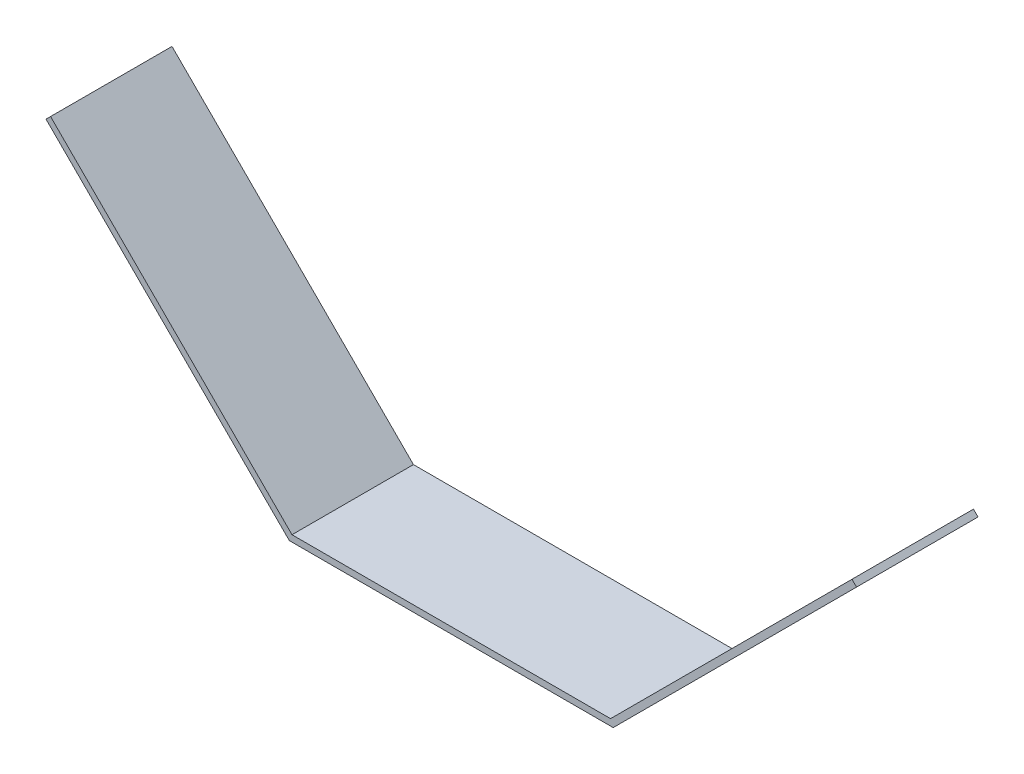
ISO-10303-21;
HEADER;
FILE_DESCRIPTION(('STEP AP214'),'2;1');
FILE_NAME('part.step','',(''),(''),'','','');
FILE_SCHEMA(('AUTOMOTIVE_DESIGN { 1 0 10303 214 1 1 1 1 }'));
ENDSEC;
DATA;
#1=APPLICATION_CONTEXT('core data for automotive mechanical design processes');
#2=APPLICATION_PROTOCOL_DEFINITION('international standard','automotive_design',2000,#1);
#3=PRODUCT_CONTEXT('',#1,'mechanical');
#4=PRODUCT('Part','Part','',(#3));
#5=PRODUCT_RELATED_PRODUCT_CATEGORY('part','',(#4));
#6=PRODUCT_DEFINITION_FORMATION('','',#4);
#7=PRODUCT_DEFINITION_CONTEXT('part definition',#1,'design');
#8=PRODUCT_DEFINITION('design','',#6,#7);
#9=PRODUCT_DEFINITION_SHAPE('','',#8);
#10=(LENGTH_UNIT() NAMED_UNIT(*) SI_UNIT(.MILLI.,.METRE.));
#11=(NAMED_UNIT(*) PLANE_ANGLE_UNIT() SI_UNIT($,.RADIAN.));
#12=(NAMED_UNIT(*) SI_UNIT($,.STERADIAN.) SOLID_ANGLE_UNIT());
#13=UNCERTAINTY_MEASURE_WITH_UNIT(LENGTH_MEASURE(1.E-05),#10,'distance_accuracy_value','');
#14=(GEOMETRIC_REPRESENTATION_CONTEXT(3) GLOBAL_UNCERTAINTY_ASSIGNED_CONTEXT((#13)) GLOBAL_UNIT_ASSIGNED_CONTEXT((#10,
#11,#12)) REPRESENTATION_CONTEXT('',''));
#15=CARTESIAN_POINT('',(0.,0.,0.));
#16=DIRECTION('',(0.,0.,1.));
#17=DIRECTION('',(1.,0.,0.));
#18=AXIS2_PLACEMENT_3D('',#15,#16,#17);
#19=CARTESIAN_POINT('',(80.,0.,60.));
#20=DIRECTION('',(-0.707106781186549,0.707106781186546,0.));
#21=DIRECTION('',(-0.707106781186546,-0.707106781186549,0.));
#22=AXIS2_PLACEMENT_3D('',#19,#20,#21);
#23=PLANE('',#22);
#24=DIRECTION('',(0.707106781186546,0.707106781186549,0.));
#25=VECTOR('',#24,1.);
#26=CARTESIAN_POINT('',(80.,0.,0.));
#27=LINE('',#26,#25);
#28=CARTESIAN_POINT('',(80.,0.,0.));
#29=VERTEX_POINT('',#28);
#30=CARTESIAN_POINT('',(200.208152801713,120.208152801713,0.));
#31=VERTEX_POINT('',#30);
#32=EDGE_CURVE('E140',#29,#31,#27,.T.);
#33=ORIENTED_EDGE('',*,*,#32,.T.);
#34=DIRECTION('',(0.,0.,-1.));
#35=VECTOR('',#34,1.);
#36=CARTESIAN_POINT('',(200.208152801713,120.208152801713,60.));
#37=LINE('',#36,#35);
#38=CARTESIAN_POINT('',(200.208152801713,120.208152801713,60.));
#39=VERTEX_POINT('',#38);
#40=EDGE_CURVE('E11',#39,#31,#37,.T.);
#41=ORIENTED_EDGE('',*,*,#40,.F.);
#42=DIRECTION('',(0.707106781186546,0.707106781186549,0.));
#43=VECTOR('',#42,1.);
#44=CARTESIAN_POINT('',(80.,0.,60.));
#45=LINE('',#44,#43);
#46=CARTESIAN_POINT('',(80.,0.,60.));
#47=VERTEX_POINT('',#46);
#48=EDGE_CURVE('E162',#47,#39,#45,.T.);
#49=ORIENTED_EDGE('',*,*,#48,.F.);
#50=DIRECTION('',(0.,0.,-1.));
#51=VECTOR('',#50,1.);
#52=CARTESIAN_POINT('',(80.,0.,60.));
#53=LINE('',#52,#51);
#54=EDGE_CURVE('E136',#47,#29,#53,.T.);
#55=ORIENTED_EDGE('',*,*,#54,.T.);
#56=EDGE_LOOP('',(#33,#41,#49,#55));
#57=FACE_BOUND('',#56,.T.);
#58=ADVANCED_FACE('F39',(#57),#23,.F.);
#59=CARTESIAN_POINT('',(200.208152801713,120.208152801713,60.));
#60=DIRECTION('',(-0.707106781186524,-0.707106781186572,0.));
#61=DIRECTION('',(0.707106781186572,-0.707106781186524,0.));
#62=AXIS2_PLACEMENT_3D('',#59,#60,#61);
#63=PLANE('',#62);
#64=DIRECTION('',(-0.707106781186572,0.707106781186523,0.));
#65=VECTOR('',#64,1.);
#66=CARTESIAN_POINT('',(200.208152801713,120.208152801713,0.));
#67=LINE('',#66,#65);
#68=CARTESIAN_POINT('',(197.963088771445,122.453216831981,0.));
#69=VERTEX_POINT('',#68);
#70=EDGE_CURVE('E144',#31,#69,#67,.T.);
#71=ORIENTED_EDGE('',*,*,#70,.T.);
#72=DIRECTION('',(0.,0.,-1.));
#73=VECTOR('',#72,1.);
#74=CARTESIAN_POINT('',(197.963088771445,122.453216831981,60.));
#75=LINE('',#74,#73);
#76=CARTESIAN_POINT('',(197.963088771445,122.453216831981,60.));
#77=VERTEX_POINT('',#76);
#78=EDGE_CURVE('E48',#77,#69,#75,.T.);
#79=ORIENTED_EDGE('',*,*,#78,.F.);
#80=DIRECTION('',(-0.707106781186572,0.707106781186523,0.));
#81=VECTOR('',#80,1.);
#82=CARTESIAN_POINT('',(200.208152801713,120.208152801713,60.));
#83=LINE('',#82,#81);
#84=EDGE_CURVE('E99',#39,#77,#83,.T.);
#85=ORIENTED_EDGE('',*,*,#84,.F.);
#86=ORIENTED_EDGE('',*,*,#40,.T.);
#87=EDGE_LOOP('',(#71,#79,#85,#86));
#88=FACE_BOUND('',#87,.T.);
#89=ADVANCED_FACE('F208',(#88),#63,.F.);
#90=CARTESIAN_POINT('',(197.963088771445,122.453216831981,60.));
#91=DIRECTION('',(0.707106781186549,-0.707106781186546,0.));
#92=DIRECTION('',(0.707106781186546,0.707106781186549,0.));
#93=AXIS2_PLACEMENT_3D('',#90,#91,#92);
#94=PLANE('',#93);
#95=DIRECTION('',(-0.707106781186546,-0.707106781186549,0.));
#96=VECTOR('',#95,1.);
#97=CARTESIAN_POINT('',(197.963088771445,122.453216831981,0.));
#98=LINE('',#97,#96);
#99=CARTESIAN_POINT('',(78.6848719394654,3.17499999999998,0.));
#100=VERTEX_POINT('',#99);
#101=EDGE_CURVE('E147',#69,#100,#98,.T.);
#102=ORIENTED_EDGE('',*,*,#101,.T.);
#103=DIRECTION('',(0.,0.,-1.));
#104=VECTOR('',#103,1.);
#105=CARTESIAN_POINT('',(78.6848719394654,3.17499999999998,60.));
#106=LINE('',#105,#104);
#107=CARTESIAN_POINT('',(78.6848719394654,3.17499999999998,60.));
#108=VERTEX_POINT('',#107);
#109=EDGE_CURVE('E173',#108,#100,#106,.T.);
#110=ORIENTED_EDGE('',*,*,#109,.F.);
#111=DIRECTION('',(-0.707106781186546,-0.707106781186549,0.));
#112=VECTOR('',#111,1.);
#113=CARTESIAN_POINT('',(197.963088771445,122.453216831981,60.));
#114=LINE('',#113,#112);
#115=EDGE_CURVE('E183',#77,#108,#114,.T.);
#116=ORIENTED_EDGE('',*,*,#115,.F.);
#117=ORIENTED_EDGE('',*,*,#78,.T.);
#118=EDGE_LOOP('',(#102,#110,#116,#117));
#119=FACE_BOUND('',#118,.T.);
#120=ADVANCED_FACE('F181',(#119),#94,.F.);
#121=CARTESIAN_POINT('',(78.6848719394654,3.17499999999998,60.));
#122=DIRECTION('',(0.,-1.,0.));
#123=DIRECTION('',(0.,0.,-1.));
#124=AXIS2_PLACEMENT_3D('',#121,#122,#123);
#125=PLANE('',#124);
#126=DIRECTION('',(-1.,0.,0.));
#127=VECTOR('',#126,1.);
#128=CARTESIAN_POINT('',(78.6848719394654,3.17499999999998,0.));
#129=LINE('',#128,#127);
#130=CARTESIAN_POINT('',(-78.6848719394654,3.17499999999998,0.));
#131=VERTEX_POINT('',#130);
#132=EDGE_CURVE('E150',#100,#131,#129,.T.);
#133=ORIENTED_EDGE('',*,*,#132,.T.);
#134=DIRECTION('',(0.,0.,-1.));
#135=VECTOR('',#134,1.);
#136=CARTESIAN_POINT('',(-78.6848719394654,3.17499999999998,60.));
#137=LINE('',#136,#135);
#138=CARTESIAN_POINT('',(-78.6848719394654,3.17499999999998,60.));
#139=VERTEX_POINT('',#138);
#140=EDGE_CURVE('E169',#139,#131,#137,.T.);
#141=ORIENTED_EDGE('',*,*,#140,.F.);
#142=DIRECTION('',(-1.,0.,0.));
#143=VECTOR('',#142,1.);
#144=CARTESIAN_POINT('',(78.6848719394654,3.17499999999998,60.));
#145=LINE('',#144,#143);
#146=EDGE_CURVE('E196',#108,#139,#145,.T.);
#147=ORIENTED_EDGE('',*,*,#146,.F.);
#148=ORIENTED_EDGE('',*,*,#109,.T.);
#149=EDGE_LOOP('',(#133,#141,#147,#148));
#150=FACE_BOUND('',#149,.T.);
#151=ADVANCED_FACE('F191',(#150),#125,.F.);
#152=CARTESIAN_POINT('',(-197.963088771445,122.453216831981,60.));
#153=DIRECTION('',(-0.707106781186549,-0.707106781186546,0.));
#154=DIRECTION('',(0.707106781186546,-0.707106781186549,0.));
#155=AXIS2_PLACEMENT_3D('',#152,#153,#154);
#156=PLANE('',#155);
#157=DIRECTION('',(-0.707106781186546,0.707106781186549,0.));
#158=VECTOR('',#157,1.);
#159=CARTESIAN_POINT('',(-197.963088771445,122.453216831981,0.));
#160=LINE('',#159,#158);
#161=CARTESIAN_POINT('',(-197.963088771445,122.453216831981,0.));
#162=VERTEX_POINT('',#161);
#163=EDGE_CURVE('E153',#131,#162,#160,.T.);
#164=ORIENTED_EDGE('',*,*,#163,.T.);
#165=DIRECTION('',(0.,0.,-1.));
#166=VECTOR('',#165,1.);
#167=CARTESIAN_POINT('',(-197.963088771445,122.453216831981,60.));
#168=LINE('',#167,#166);
#169=CARTESIAN_POINT('',(-197.963088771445,122.453216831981,60.));
#170=VERTEX_POINT('',#169);
#171=EDGE_CURVE('E129',#170,#162,#168,.T.);
#172=ORIENTED_EDGE('',*,*,#171,.F.);
#173=DIRECTION('',(-0.707106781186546,0.707106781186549,0.));
#174=VECTOR('',#173,1.);
#175=CARTESIAN_POINT('',(-197.963088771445,122.453216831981,60.));
#176=LINE('',#175,#174);
#177=EDGE_CURVE('E118',#139,#170,#176,.T.);
#178=ORIENTED_EDGE('',*,*,#177,.F.);
#179=ORIENTED_EDGE('',*,*,#140,.T.);
#180=EDGE_LOOP('',(#164,#172,#178,#179));
#181=FACE_BOUND('',#180,.T.);
#182=ADVANCED_FACE('F194',(#181),#156,.F.);
#183=CARTESIAN_POINT('',(-200.208152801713,120.208152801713,60.));
#184=DIRECTION('',(0.707106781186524,-0.707106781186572,0.));
#185=DIRECTION('',(0.707106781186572,0.707106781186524,0.));
#186=AXIS2_PLACEMENT_3D('',#183,#184,#185);
#187=PLANE('',#186);
#188=DIRECTION('',(-0.707106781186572,-0.707106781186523,0.));
#189=VECTOR('',#188,1.);
#190=CARTESIAN_POINT('',(-200.208152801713,120.208152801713,0.));
#191=LINE('',#190,#189);
#192=CARTESIAN_POINT('',(-200.208152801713,120.208152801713,0.));
#193=VERTEX_POINT('',#192);
#194=EDGE_CURVE('E127',#162,#193,#191,.T.);
#195=ORIENTED_EDGE('',*,*,#194,.T.);
#196=DIRECTION('',(0.,0.,-1.));
#197=VECTOR('',#196,1.);
#198=CARTESIAN_POINT('',(-200.208152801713,120.208152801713,60.));
#199=LINE('',#198,#197);
#200=CARTESIAN_POINT('',(-200.208152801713,120.208152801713,60.));
#201=VERTEX_POINT('',#200);
#202=EDGE_CURVE('E124',#201,#193,#199,.T.);
#203=ORIENTED_EDGE('',*,*,#202,.F.);
#204=DIRECTION('',(-0.707106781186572,-0.707106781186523,0.));
#205=VECTOR('',#204,1.);
#206=CARTESIAN_POINT('',(-200.208152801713,120.208152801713,60.));
#207=LINE('',#206,#205);
#208=EDGE_CURVE('E112',#170,#201,#207,.T.);
#209=ORIENTED_EDGE('',*,*,#208,.F.);
#210=ORIENTED_EDGE('',*,*,#171,.T.);
#211=EDGE_LOOP('',(#195,#203,#209,#210));
#212=FACE_BOUND('',#211,.T.);
#213=ADVANCED_FACE('F125',(#212),#187,.F.);
#214=CARTESIAN_POINT('',(-80.,0.,60.));
#215=DIRECTION('',(0.707106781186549,0.707106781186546,0.));
#216=DIRECTION('',(-0.707106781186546,0.707106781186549,0.));
#217=AXIS2_PLACEMENT_3D('',#214,#215,#216);
#218=PLANE('',#217);
#219=DIRECTION('',(0.707106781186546,-0.707106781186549,0.));
#220=VECTOR('',#219,1.);
#221=CARTESIAN_POINT('',(-80.,0.,0.));
#222=LINE('',#221,#220);
#223=CARTESIAN_POINT('',(-80.,0.,0.));
#224=VERTEX_POINT('',#223);
#225=EDGE_CURVE('E85',#193,#224,#222,.T.);
#226=ORIENTED_EDGE('',*,*,#225,.T.);
#227=DIRECTION('',(0.,0.,-1.));
#228=VECTOR('',#227,1.);
#229=CARTESIAN_POINT('',(-80.,0.,60.));
#230=LINE('',#229,#228);
#231=CARTESIAN_POINT('',(-80.,0.,60.));
#232=VERTEX_POINT('',#231);
#233=EDGE_CURVE('E130',#232,#224,#230,.T.);
#234=ORIENTED_EDGE('',*,*,#233,.F.);
#235=DIRECTION('',(0.707106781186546,-0.707106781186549,0.));
#236=VECTOR('',#235,1.);
#237=CARTESIAN_POINT('',(-80.,0.,60.));
#238=LINE('',#237,#236);
#239=EDGE_CURVE('E116',#201,#232,#238,.T.);
#240=ORIENTED_EDGE('',*,*,#239,.F.);
#241=ORIENTED_EDGE('',*,*,#202,.T.);
#242=EDGE_LOOP('',(#226,#234,#240,#241));
#243=FACE_BOUND('',#242,.T.);
#244=ADVANCED_FACE('F132',(#243),#218,.F.);
#245=CARTESIAN_POINT('',(-80.,0.,60.));
#246=DIRECTION('',(0.,1.,0.));
#247=DIRECTION('',(0.,0.,1.));
#248=AXIS2_PLACEMENT_3D('',#245,#246,#247);
#249=PLANE('',#248);
#250=DIRECTION('',(1.,0.,0.));
#251=VECTOR('',#250,1.);
#252=CARTESIAN_POINT('',(-80.,0.,0.));
#253=LINE('',#252,#251);
#254=EDGE_CURVE('E91',#224,#29,#253,.T.);
#255=ORIENTED_EDGE('',*,*,#254,.T.);
#256=ORIENTED_EDGE('',*,*,#54,.F.);
#257=DIRECTION('',(1.,0.,0.));
#258=VECTOR('',#257,1.);
#259=CARTESIAN_POINT('',(-80.,0.,60.));
#260=LINE('',#259,#258);
#261=EDGE_CURVE('E56',#232,#47,#260,.T.);
#262=ORIENTED_EDGE('',*,*,#261,.F.);
#263=ORIENTED_EDGE('',*,*,#233,.T.);
#264=EDGE_LOOP('',(#255,#256,#262,#263));
#265=FACE_BOUND('',#264,.T.);
#266=ADVANCED_FACE('F224',(#265),#249,.F.);
#267=CARTESIAN_POINT('',(0.,0.,60.));
#268=DIRECTION('',(0.,0.,1.));
#269=DIRECTION('',(1.,0.,0.));
#270=AXIS2_PLACEMENT_3D('',#267,#268,#269);
#271=PLANE('',#270);
#272=ORIENTED_EDGE('',*,*,#48,.T.);
#273=ORIENTED_EDGE('',*,*,#84,.T.);
#274=ORIENTED_EDGE('',*,*,#115,.T.);
#275=ORIENTED_EDGE('',*,*,#146,.T.);
#276=ORIENTED_EDGE('',*,*,#177,.T.);
#277=ORIENTED_EDGE('',*,*,#208,.T.);
#278=ORIENTED_EDGE('',*,*,#239,.T.);
#279=ORIENTED_EDGE('',*,*,#261,.T.);
#280=EDGE_LOOP('',(#272,#273,#274,#275,#276,#277,#278,#279));
#281=FACE_BOUND('',#280,.T.);
#282=ADVANCED_FACE('F114',(#281),#271,.T.);
#283=CARTESIAN_POINT('',(0.,0.,0.));
#284=DIRECTION('',(0.,0.,1.));
#285=DIRECTION('',(1.,0.,0.));
#286=AXIS2_PLACEMENT_3D('',#283,#284,#285);
#287=PLANE('',#286);
#288=ORIENTED_EDGE('',*,*,#32,.F.);
#289=ORIENTED_EDGE('',*,*,#254,.F.);
#290=ORIENTED_EDGE('',*,*,#225,.F.);
#291=ORIENTED_EDGE('',*,*,#194,.F.);
#292=ORIENTED_EDGE('',*,*,#163,.F.);
#293=ORIENTED_EDGE('',*,*,#132,.F.);
#294=ORIENTED_EDGE('',*,*,#101,.F.);
#295=ORIENTED_EDGE('',*,*,#70,.F.);
#296=EDGE_LOOP('',(#288,#289,#290,#291,#292,#293,#294,#295));
#297=FACE_BOUND('',#296,.T.);
#298=ADVANCED_FACE('F187',(#297),#287,.F.);
#299=CLOSED_SHELL('',(#58,#89,#120,#151,#182,#213,#244,#266,#282,#298));
#300=MANIFOLD_SOLID_BREP('B2',#299);
#301=ADVANCED_BREP_SHAPE_REPRESENTATION('',(#18,#300),#14);
#302=SHAPE_DEFINITION_REPRESENTATION(#9,#301);
ENDSEC;
END-ISO-10303-21;
